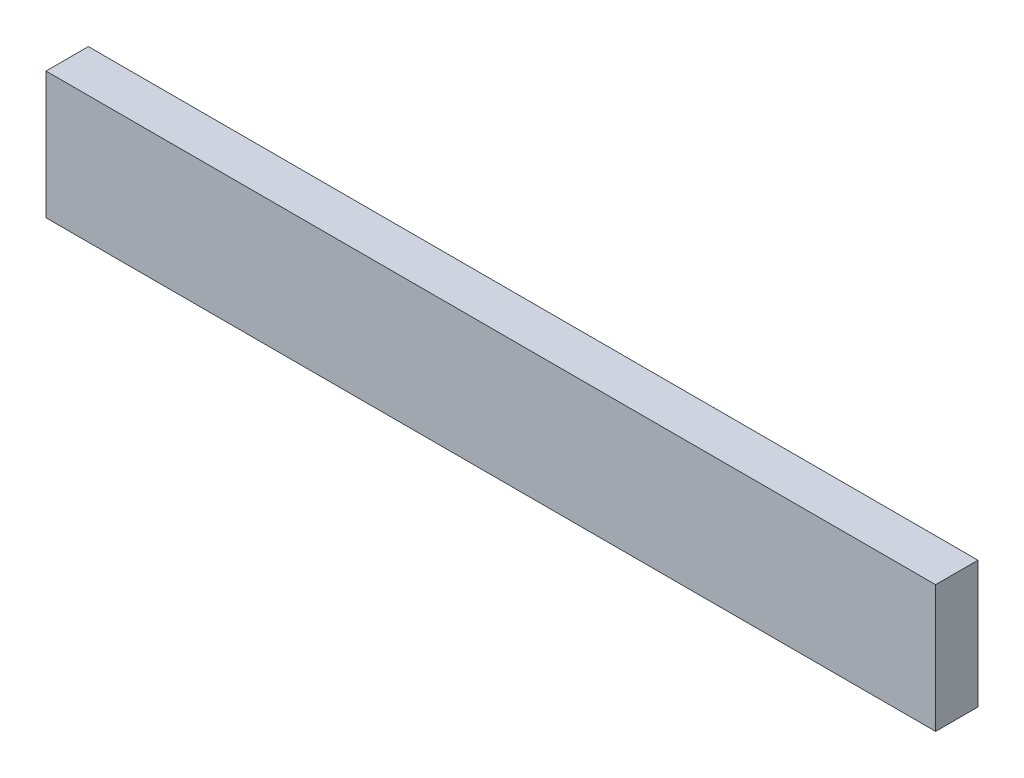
from build123d import *

# Parameters (mm, degrees)
SKETCH1_W           = 63
SKETCH1_H           = 9
BOSS_EXTRUDE1_DEPTH = 3


with BuildPart() as part:
    # Sketch1 → Boss-Extrude1 (new body)
    with BuildSketch(Plane.XY):
        Rectangle(SKETCH1_W, SKETCH1_H)
    extrude(amount=BOSS_EXTRUDE1_DEPTH)


solid = part.part
